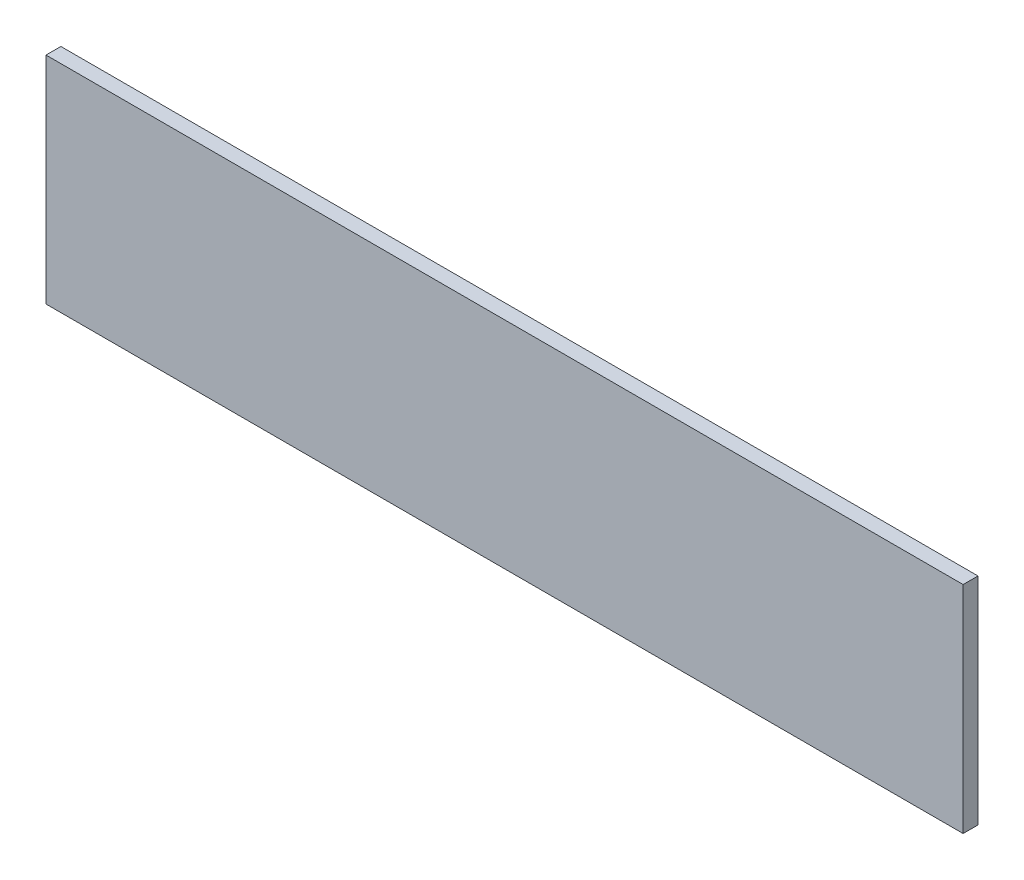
from build123d import *

# Parameters (mm, degrees)
SKETCH_1_W      = 370
SKETCH_1_H      = 87
EXTRUDE_1_DEPTH = 6


with BuildPart() as part:
    # Sketch 1 → Extrude 1 (new body)
    with BuildSketch(Plane.XY):
        with Locations((185, 43.5)):
            Rectangle(SKETCH_1_W, SKETCH_1_H)
    extrude(amount=EXTRUDE_1_DEPTH)


solid = part.part
